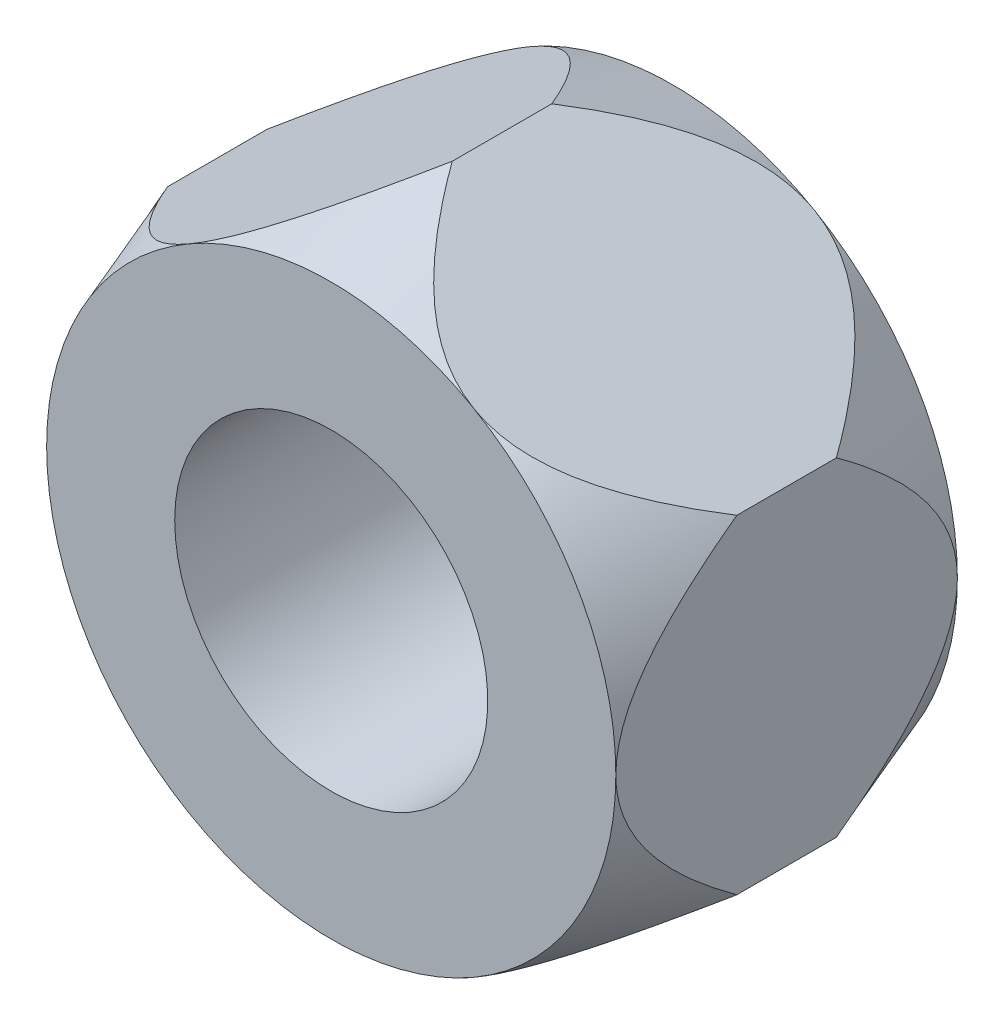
from build123d import *

# Parameters (mm, degrees)
BOSS_EXTRUDE1_DEPTH = 6
SKETCH2_OUTSIDE_W   = 19.65
SKETCH2_OUTSIDE_H   = 21.198
SKETCH2_OUTSIDE_R   = 5
CUT_EXTRUDE1_DEPTH  = 6
CUT_EXTRUDE1_DRAFT  = -20
SKETCH3_OUTSIDE_W   = 19.65
SKETCH3_OUTSIDE_H   = 21.198
SKETCH3_OUTSIDE_R   = 5
CUT_EXTRUDE2_DEPTH  = 6
CUT_EXTRUDE2_DRAFT  = -20
SKETCH4_R           = 2.75
CUT_EXTRUDE3_DEPTH  = 6


with BuildPart() as part:
    # Sketch1 → Boss-Extrude1 (new body)
    with BuildSketch(Plane.XY):
        Polygon((0, 5.773502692), (-5, 2.886751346), (-5, -2.886751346), (0, -5.773502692), (5, -2.886751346), (5, 2.886751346), align=None)
    extrude(amount=BOSS_EXTRUDE1_DEPTH)


with BuildPart() as cut_extrude1_tool:
    # Sketch2 outside → Cut-Extrude1 (with draft: the straight prism first)
    with BuildSketch(Plane.XY.offset(6)):
        Rectangle(SKETCH2_OUTSIDE_W, SKETCH2_OUTSIDE_H)
        Circle(SKETCH2_OUTSIDE_R, mode=Mode.SUBTRACT)
    extrude(amount=-CUT_EXTRUDE1_DEPTH)
    # Cut-Extrude1: the draft: its side faces are tilted about the plane it starts from
    cut_extrude1_sides = [cut_extrude1_tool.faces().sort_by_distance(p)[0] for p in [
        (0, -10.599, 3),
        (9.825, 0, 3),
        (0, 10.599, 3),
        (-9.825, 0, 3),
        (-5, 0, 3),
    ]]
    draft(cut_extrude1_sides, Plane.XY.offset(6), CUT_EXTRUDE1_DRAFT)


with BuildPart() as part_1:
    add(part.part)

    # Cut-Extrude1: cut by cut_extrude1_tool
    add(cut_extrude1_tool.part, mode=Mode.SUBTRACT)


with BuildPart() as cut_extrude2_tool:
    # Sketch3 outside → Cut-Extrude2 (with draft: the straight prism first)
    with BuildSketch(Plane(origin=(0, 0, 0), x_dir=(-1, 0, 0), z_dir=(0, 0, -1))):
        Rectangle(SKETCH3_OUTSIDE_W, SKETCH3_OUTSIDE_H)
        Circle(SKETCH3_OUTSIDE_R, mode=Mode.SUBTRACT)
    extrude(amount=-CUT_EXTRUDE2_DEPTH)
    # Cut-Extrude2: the draft: its side faces are tilted about the plane it starts from
    cut_extrude2_sides = [cut_extrude2_tool.faces().sort_by_distance(p)[0] for p in [
        (0, -10.599, 3),
        (-9.825, 0, 3),
        (0, 10.599, 3),
        (9.825, 0, 3),
        (5, 0, 3),
    ]]
    draft(cut_extrude2_sides, Plane(origin=(0, 0, 0), x_dir=(-1, 0, 0), z_dir=(0, 0, -1)), CUT_EXTRUDE2_DRAFT)


with BuildPart() as part_2:
    add(part_1.part)

    # Cut-Extrude2: cut by cut_extrude2_tool
    add(cut_extrude2_tool.part, mode=Mode.SUBTRACT)

    # Sketch4 → Cut-Extrude3 (cut)
    with BuildSketch(Plane(origin=(0, 0, 0), x_dir=(-1, 0, 0), z_dir=(0, 0, -1))):
        Circle(SKETCH4_R)
    extrude(amount=-CUT_EXTRUDE3_DEPTH, mode=Mode.SUBTRACT)


solid = part_2.part
